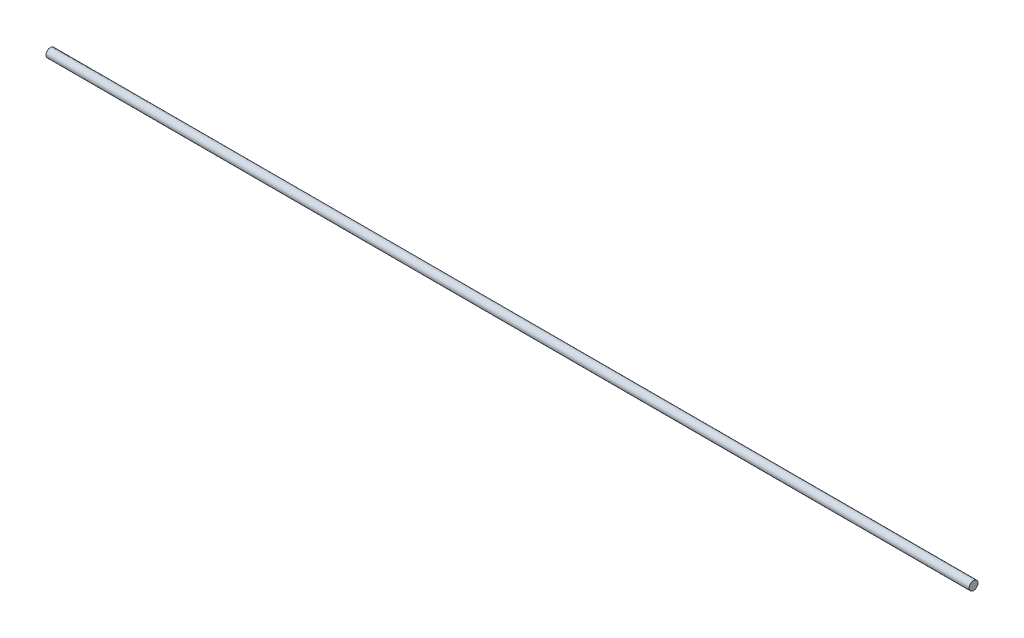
ISO-10303-21;
HEADER;
FILE_DESCRIPTION(('STEP AP214'),'2;1');
FILE_NAME('part.step','',(''),(''),'','','');
FILE_SCHEMA(('AUTOMOTIVE_DESIGN { 1 0 10303 214 1 1 1 1 }'));
ENDSEC;
DATA;
#1=APPLICATION_CONTEXT('core data for automotive mechanical design processes');
#2=APPLICATION_PROTOCOL_DEFINITION('international standard','automotive_design',2000,#1);
#3=PRODUCT_CONTEXT('',#1,'mechanical');
#4=PRODUCT('Part','Part','',(#3));
#5=PRODUCT_RELATED_PRODUCT_CATEGORY('part','',(#4));
#6=PRODUCT_DEFINITION_FORMATION('','',#4);
#7=PRODUCT_DEFINITION_CONTEXT('part definition',#1,'design');
#8=PRODUCT_DEFINITION('design','',#6,#7);
#9=PRODUCT_DEFINITION_SHAPE('','',#8);
#10=(LENGTH_UNIT() NAMED_UNIT(*) SI_UNIT(.MILLI.,.METRE.));
#11=(NAMED_UNIT(*) PLANE_ANGLE_UNIT() SI_UNIT($,.RADIAN.));
#12=(NAMED_UNIT(*) SI_UNIT($,.STERADIAN.) SOLID_ANGLE_UNIT());
#13=UNCERTAINTY_MEASURE_WITH_UNIT(LENGTH_MEASURE(1.E-05),#10,'distance_accuracy_value','');
#14=(GEOMETRIC_REPRESENTATION_CONTEXT(3) GLOBAL_UNCERTAINTY_ASSIGNED_CONTEXT((#13)) GLOBAL_UNIT_ASSIGNED_CONTEXT((#10,
#11,#12)) REPRESENTATION_CONTEXT('',''));
#15=CARTESIAN_POINT('',(0.,0.,0.));
#16=DIRECTION('',(0.,0.,1.));
#17=DIRECTION('',(1.,0.,0.));
#18=AXIS2_PLACEMENT_3D('',#15,#16,#17);
#19=CARTESIAN_POINT('',(2996.55,0.,0.));
#20=DIRECTION('',(-1.,0.,0.));
#21=DIRECTION('',(0.,0.,1.));
#22=AXIS2_PLACEMENT_3D('',#19,#20,#21);
#23=CYLINDRICAL_SURFACE('',#22,28.6639);
#24=CARTESIAN_POINT('',(2996.55,0.,0.));
#25=DIRECTION('',(1.,0.,0.));
#26=DIRECTION('',(0.,0.,-1.));
#27=AXIS2_PLACEMENT_3D('',#24,#25,#26);
#28=CIRCLE('',#27,28.6639);
#29=CARTESIAN_POINT('',(2996.55,0.,-28.6639));
#30=VERTEX_POINT('',#29);
#31=EDGE_CURVE('E10',#30,#30,#28,.T.);
#32=ORIENTED_EDGE('',*,*,#31,.F.);
#33=EDGE_LOOP('',(#32));
#34=FACE_BOUND('',#33,.T.);
#35=CARTESIAN_POINT('',(-2996.55,0.,0.));
#36=DIRECTION('',(1.,0.,0.));
#37=DIRECTION('',(0.,0.,-1.));
#38=AXIS2_PLACEMENT_3D('',#35,#36,#37);
#39=CIRCLE('',#38,28.6639);
#40=CARTESIAN_POINT('',(-2996.55,0.,-28.6639));
#41=VERTEX_POINT('',#40);
#42=EDGE_CURVE('E46',#41,#41,#39,.T.);
#43=ORIENTED_EDGE('',*,*,#42,.T.);
#44=EDGE_LOOP('',(#43));
#45=FACE_BOUND('',#44,.T.);
#46=ADVANCED_FACE('F43',(#34,#45),#23,.T.);
#47=CARTESIAN_POINT('',(2996.55,0.,0.));
#48=DIRECTION('',(1.,0.,0.));
#49=DIRECTION('',(0.,0.,-1.));
#50=AXIS2_PLACEMENT_3D('',#47,#48,#49);
#51=PLANE('',#50);
#52=ORIENTED_EDGE('',*,*,#31,.T.);
#53=EDGE_LOOP('',(#52));
#54=FACE_BOUND('',#53,.T.);
#55=ADVANCED_FACE('F58',(#54),#51,.T.);
#56=CARTESIAN_POINT('',(-2996.55,0.,0.));
#57=DIRECTION('',(1.,0.,0.));
#58=DIRECTION('',(0.,0.,-1.));
#59=AXIS2_PLACEMENT_3D('',#56,#57,#58);
#60=PLANE('',#59);
#61=ORIENTED_EDGE('',*,*,#42,.F.);
#62=EDGE_LOOP('',(#61));
#63=FACE_BOUND('',#62,.T.);
#64=ADVANCED_FACE('F59',(#63),#60,.F.);
#65=CLOSED_SHELL('',(#46,#55,#64));
#66=MANIFOLD_SOLID_BREP('B2',#65);
#67=ADVANCED_BREP_SHAPE_REPRESENTATION('',(#18,#66),#14);
#68=SHAPE_DEFINITION_REPRESENTATION(#9,#67);
ENDSEC;
END-ISO-10303-21;
